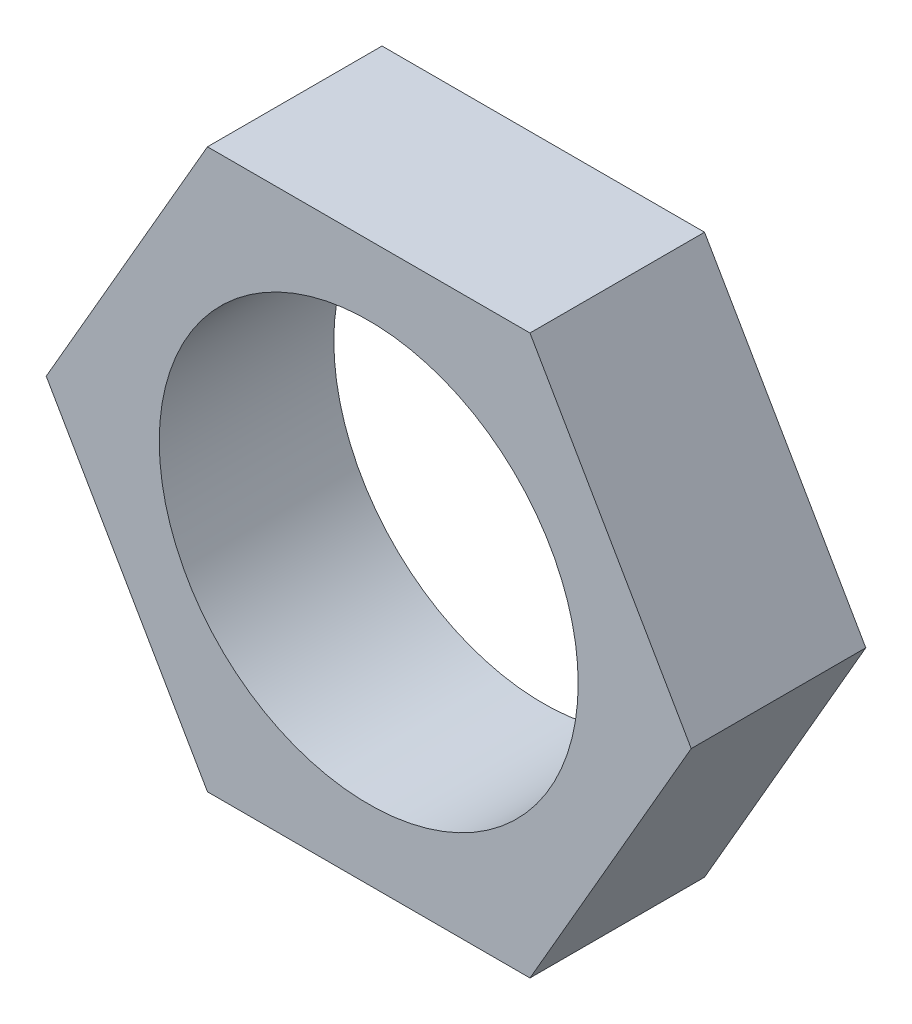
from build123d import *

# Parameters (mm, degrees)
SKETCH1_R           = 6
BOSS_EXTRUDE1_DEPTH = 5


with BuildPart() as part:
    # Sketch1 → Boss-Extrude1 (new body)
    with BuildSketch(Plane.XY):
        Polygon((9.237604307, 0), (4.618802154, 8), (-4.618802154, 8), (-9.237604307, 0), (-4.618802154, -8), (4.618802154, -8), align=None)
        Circle(SKETCH1_R, mode=Mode.SUBTRACT)
    extrude(amount=BOSS_EXTRUDE1_DEPTH)


solid = part.part
